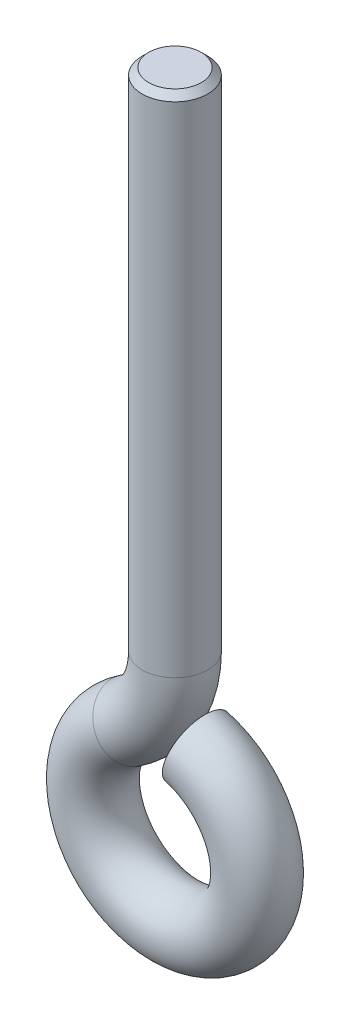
ISO-10303-21;
HEADER;
FILE_DESCRIPTION(('STEP AP214'),'2;1');
FILE_NAME('part.step','',(''),(''),'','','');
FILE_SCHEMA(('AUTOMOTIVE_DESIGN { 1 0 10303 214 1 1 1 1 }'));
ENDSEC;
DATA;
#1=APPLICATION_CONTEXT('core data for automotive mechanical design processes');
#2=APPLICATION_PROTOCOL_DEFINITION('international standard','automotive_design',2000,#1);
#3=PRODUCT_CONTEXT('',#1,'mechanical');
#4=PRODUCT('Part','Part','',(#3));
#5=PRODUCT_RELATED_PRODUCT_CATEGORY('part','',(#4));
#6=PRODUCT_DEFINITION_FORMATION('','',#4);
#7=PRODUCT_DEFINITION_CONTEXT('part definition',#1,'design');
#8=PRODUCT_DEFINITION('design','',#6,#7);
#9=PRODUCT_DEFINITION_SHAPE('','',#8);
#10=(LENGTH_UNIT() NAMED_UNIT(*) SI_UNIT(.MILLI.,.METRE.));
#11=(NAMED_UNIT(*) PLANE_ANGLE_UNIT() SI_UNIT($,.RADIAN.));
#12=(NAMED_UNIT(*) SI_UNIT($,.STERADIAN.) SOLID_ANGLE_UNIT());
#13=UNCERTAINTY_MEASURE_WITH_UNIT(LENGTH_MEASURE(1.E-05),#10,'distance_accuracy_value','');
#14=(GEOMETRIC_REPRESENTATION_CONTEXT(3) GLOBAL_UNCERTAINTY_ASSIGNED_CONTEXT((#13)) GLOBAL_UNIT_ASSIGNED_CONTEXT((#10,
#11,#12)) REPRESENTATION_CONTEXT('',''));
#15=CARTESIAN_POINT('',(0.,0.,0.));
#16=DIRECTION('',(0.,0.,1.));
#17=DIRECTION('',(1.,0.,0.));
#18=AXIS2_PLACEMENT_3D('',#15,#16,#17);
#19=CARTESIAN_POINT('',(0.,0.,0.));
#20=DIRECTION('',(0.,0.,1.));
#21=DIRECTION('',(1.,0.,0.));
#22=AXIS2_PLACEMENT_3D('',#19,#20,#21);
#23=TOROIDAL_SURFACE('',#22,25.,10.);
#24=CARTESIAN_POINT('',(-13.6363636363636,20.9535101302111,0.));
#25=DIRECTION('',(0.838140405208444,0.545454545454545,0.));
#26=DIRECTION('',(0.,0.,1.));
#27=AXIS2_PLACEMENT_3D('',#24,#25,#26);
#28=CIRCLE('',#27,10.);
#29=CARTESIAN_POINT('',(-19.0909090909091,29.3349141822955,0.));
#30=VERTEX_POINT('',#29);
#31=EDGE_CURVE('E43',#30,#30,#28,.T.);
#32=CARTESIAN_POINT('',(6.47047612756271,24.1481456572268,0.));
#33=DIRECTION('',(0.965925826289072,-0.258819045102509,0.));
#34=DIRECTION('',(0.,0.,1.));
#35=AXIS2_PLACEMENT_3D('',#32,#33,#34);
#36=CIRCLE('',#35,10.);
#37=CARTESIAN_POINT('',(9.0586665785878,33.8074039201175,0.));
#38=VERTEX_POINT('',#37);
#39=EDGE_CURVE('E39',#38,#38,#36,.T.);
#40=CARTESIAN_POINT('',(0.,0.,0.));
#41=DIRECTION('',(0.,0.,1.));
#42=DIRECTION('',(1.,0.,0.));
#43=AXIS2_PLACEMENT_3D('',#40,#41,#42);
#44=CIRCLE('',#43,35.);
#45=EDGE_CURVE('',#30,#38,#44,.T.);
#46=ORIENTED_EDGE('',*,*,#31,.F.);
#47=ORIENTED_EDGE('',*,*,#39,.T.);
#48=ORIENTED_EDGE('',*,*,#45,.T.);
#49=ORIENTED_EDGE('',*,*,#45,.F.);
#50=EDGE_LOOP('',(#46,#48,#47,#49));
#51=FACE_BOUND('',#50,.T.);
#52=ADVANCED_FACE('F28',(#51),#23,.T.);
#53=CARTESIAN_POINT('',(-30.,46.0977222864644,0.));
#54=DIRECTION('',(0.,0.,-1.));
#55=DIRECTION('',(-1.,0.,0.));
#56=AXIS2_PLACEMENT_3D('',#53,#54,#55);
#57=TOROIDAL_SURFACE('',#56,30.,10.);
#58=CARTESIAN_POINT('',(0.,46.0977222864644,0.));
#59=DIRECTION('',(0.,1.,0.));
#60=DIRECTION('',(0.,0.,1.));
#61=AXIS2_PLACEMENT_3D('',#58,#59,#60);
#62=CIRCLE('',#61,10.);
#63=CARTESIAN_POINT('',(0.,46.0977222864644,10.));
#64=VERTEX_POINT('',#63);
#65=EDGE_CURVE('E48',#64,#64,#62,.T.);
#66=ORIENTED_EDGE('',*,*,#65,.F.);
#67=EDGE_LOOP('',(#66));
#68=FACE_BOUND('',#67,.T.);
#69=ORIENTED_EDGE('',*,*,#31,.T.);
#70=EDGE_LOOP('',(#69));
#71=FACE_BOUND('',#70,.T.);
#72=ADVANCED_FACE('F54',(#68,#71),#57,.T.);
#73=CARTESIAN_POINT('',(0.,46.0977222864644,0.));
#74=DIRECTION('',(0.,1.,0.));
#75=DIRECTION('',(0.,0.,1.));
#76=AXIS2_PLACEMENT_3D('',#73,#74,#75);
#77=CYLINDRICAL_SURFACE('',#76,10.);
#78=CARTESIAN_POINT('',(0.,198.,0.));
#79=DIRECTION('',(0.,1.,0.));
#80=DIRECTION('',(0.,0.,1.));
#81=AXIS2_PLACEMENT_3D('',#78,#79,#80);
#82=CIRCLE('',#81,10.);
#83=CARTESIAN_POINT('',(0.,198.,10.));
#84=VERTEX_POINT('',#83);
#85=EDGE_CURVE('E10',#84,#84,#82,.F.);
#86=ORIENTED_EDGE('',*,*,#85,.T.);
#87=EDGE_LOOP('',(#86));
#88=FACE_BOUND('',#87,.T.);
#89=ORIENTED_EDGE('',*,*,#65,.T.);
#90=EDGE_LOOP('',(#89));
#91=FACE_BOUND('',#90,.T.);
#92=ADVANCED_FACE('F52',(#88,#91),#77,.T.);
#93=CARTESIAN_POINT('',(6.47047612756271,24.1481456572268,0.));
#94=DIRECTION('',(0.965925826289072,-0.258819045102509,0.));
#95=DIRECTION('',(0.,0.,1.));
#96=AXIS2_PLACEMENT_3D('',#93,#94,#95);
#97=PLANE('',#96);
#98=ORIENTED_EDGE('',*,*,#39,.F.);
#99=EDGE_LOOP('',(#98));
#100=FACE_BOUND('',#99,.T.);
#101=ADVANCED_FACE('F64',(#100),#97,.F.);
#102=CARTESIAN_POINT('',(0.,200.,0.));
#103=DIRECTION('',(0.,1.,0.));
#104=DIRECTION('',(0.,0.,1.));
#105=AXIS2_PLACEMENT_3D('',#102,#103,#104);
#106=PLANE('',#105);
#107=CARTESIAN_POINT('',(0.,200.,0.));
#108=DIRECTION('',(0.,1.,0.));
#109=DIRECTION('',(0.,0.,1.));
#110=AXIS2_PLACEMENT_3D('',#107,#108,#109);
#111=CIRCLE('',#110,8.00000000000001);
#112=CARTESIAN_POINT('',(0.,200.,8.00000000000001));
#113=VERTEX_POINT('',#112);
#114=EDGE_CURVE('E35',#113,#113,#111,.T.);
#115=ORIENTED_EDGE('',*,*,#114,.T.);
#116=EDGE_LOOP('',(#115));
#117=FACE_BOUND('',#116,.T.);
#118=ADVANCED_FACE('F66',(#117),#106,.T.);
#119=CARTESIAN_POINT('',(0.,200.,0.));
#120=DIRECTION('',(0.,-1.,0.));
#121=DIRECTION('',(0.,0.,-1.));
#122=AXIS2_PLACEMENT_3D('',#119,#120,#121);
#123=CONICAL_SURFACE('',#122,8.00000000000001,0.785398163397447);
#124=ORIENTED_EDGE('',*,*,#85,.F.);
#125=EDGE_LOOP('',(#124));
#126=FACE_BOUND('',#125,.T.);
#127=ORIENTED_EDGE('',*,*,#114,.F.);
#128=EDGE_LOOP('',(#127));
#129=FACE_BOUND('',#128,.T.);
#130=ADVANCED_FACE('F30',(#126,#129),#123,.T.);
#131=CLOSED_SHELL('',(#52,#72,#92,#101,#118,#130));
#132=MANIFOLD_SOLID_BREP('B2',#131);
#133=ADVANCED_BREP_SHAPE_REPRESENTATION('',(#18,#132),#14);
#134=SHAPE_DEFINITION_REPRESENTATION(#9,#133);
ENDSEC;
END-ISO-10303-21;
